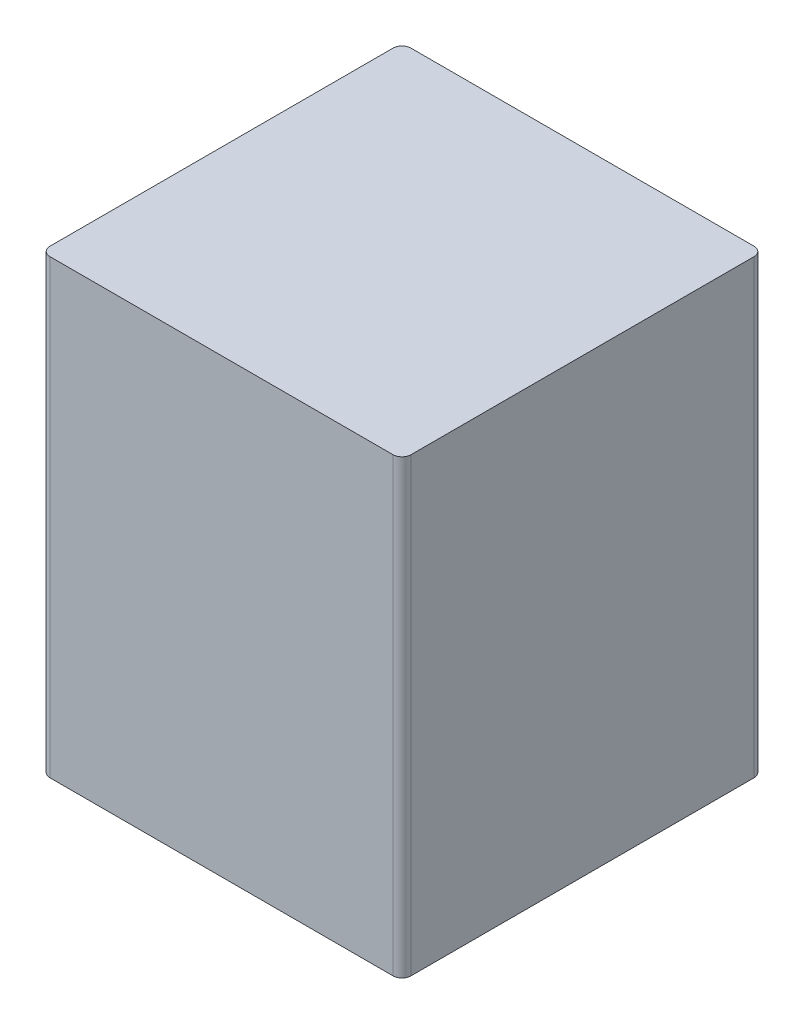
ISO-10303-21;
HEADER;
FILE_DESCRIPTION(('STEP AP214'),'2;1');
FILE_NAME('part.step','',(''),(''),'','','');
FILE_SCHEMA(('AUTOMOTIVE_DESIGN { 1 0 10303 214 1 1 1 1 }'));
ENDSEC;
DATA;
#1=APPLICATION_CONTEXT('core data for automotive mechanical design processes');
#2=APPLICATION_PROTOCOL_DEFINITION('international standard','automotive_design',2000,#1);
#3=PRODUCT_CONTEXT('',#1,'mechanical');
#4=PRODUCT('Part','Part','',(#3));
#5=PRODUCT_RELATED_PRODUCT_CATEGORY('part','',(#4));
#6=PRODUCT_DEFINITION_FORMATION('','',#4);
#7=PRODUCT_DEFINITION_CONTEXT('part definition',#1,'design');
#8=PRODUCT_DEFINITION('design','',#6,#7);
#9=PRODUCT_DEFINITION_SHAPE('','',#8);
#10=(LENGTH_UNIT() NAMED_UNIT(*) SI_UNIT(.MILLI.,.METRE.));
#11=(NAMED_UNIT(*) PLANE_ANGLE_UNIT() SI_UNIT($,.RADIAN.));
#12=(NAMED_UNIT(*) SI_UNIT($,.STERADIAN.) SOLID_ANGLE_UNIT());
#13=UNCERTAINTY_MEASURE_WITH_UNIT(LENGTH_MEASURE(1.E-05),#10,'distance_accuracy_value','');
#14=(GEOMETRIC_REPRESENTATION_CONTEXT(3) GLOBAL_UNCERTAINTY_ASSIGNED_CONTEXT((#13)) GLOBAL_UNIT_ASSIGNED_CONTEXT((#10,
#11,#12)) REPRESENTATION_CONTEXT('',''));
#15=CARTESIAN_POINT('',(0.,0.,0.));
#16=DIRECTION('',(0.,0.,1.));
#17=DIRECTION('',(1.,0.,0.));
#18=AXIS2_PLACEMENT_3D('',#15,#16,#17);
#19=CARTESIAN_POINT('',(-0.38,-0.5,0.38));
#20=DIRECTION('',(0.,-1.,0.));
#21=DIRECTION('',(0.,0.,1.));
#22=AXIS2_PLACEMENT_3D('',#19,#20,#21);
#23=CYLINDRICAL_SURFACE('',#22,0.02);
#24=CARTESIAN_POINT('',(-0.38,0.5,0.38));
#25=DIRECTION('',(0.,-1.,0.));
#26=DIRECTION('',(0.,0.,-1.));
#27=AXIS2_PLACEMENT_3D('',#24,#25,#26);
#28=CIRCLE('',#27,0.02);
#29=CARTESIAN_POINT('',(-0.38,0.5,0.4));
#30=VERTEX_POINT('',#29);
#31=CARTESIAN_POINT('',(-0.4,0.5,0.38));
#32=VERTEX_POINT('',#31);
#33=EDGE_CURVE('E20',#30,#32,#28,.T.);
#34=ORIENTED_EDGE('',*,*,#33,.T.);
#35=DIRECTION('',(0.,-1.,0.));
#36=VECTOR('',#35,1.);
#37=CARTESIAN_POINT('',(-0.4,0.5,0.38));
#38=LINE('',#37,#36);
#39=CARTESIAN_POINT('',(-0.4,-0.5,0.38));
#40=VERTEX_POINT('',#39);
#41=EDGE_CURVE('E170',#32,#40,#38,.T.);
#42=ORIENTED_EDGE('',*,*,#41,.T.);
#43=CARTESIAN_POINT('',(-0.38,-0.5,0.38));
#44=DIRECTION('',(0.,1.,0.));
#45=DIRECTION('',(0.,0.,1.));
#46=AXIS2_PLACEMENT_3D('',#43,#44,#45);
#47=CIRCLE('',#46,0.02);
#48=CARTESIAN_POINT('',(-0.38,-0.5,0.4));
#49=VERTEX_POINT('',#48);
#50=EDGE_CURVE('E117',#40,#49,#47,.T.);
#51=ORIENTED_EDGE('',*,*,#50,.T.);
#52=DIRECTION('',(0.,-1.,0.));
#53=VECTOR('',#52,1.);
#54=CARTESIAN_POINT('',(-0.38,-0.5,0.4));
#55=LINE('',#54,#53);
#56=EDGE_CURVE('E147',#30,#49,#55,.T.);
#57=ORIENTED_EDGE('',*,*,#56,.F.);
#58=EDGE_LOOP('',(#34,#42,#51,#57));
#59=FACE_BOUND('',#58,.T.);
#60=ADVANCED_FACE('F17',(#59),#23,.T.);
#61=CARTESIAN_POINT('',(-0.38,0.5,-0.38));
#62=DIRECTION('',(0.,1.,0.));
#63=DIRECTION('',(0.,0.,-1.));
#64=AXIS2_PLACEMENT_3D('',#61,#62,#63);
#65=CYLINDRICAL_SURFACE('',#64,0.02);
#66=CARTESIAN_POINT('',(-0.38,0.5,-0.38));
#67=DIRECTION('',(0.,-1.,0.));
#68=DIRECTION('',(0.,0.,-1.));
#69=AXIS2_PLACEMENT_3D('',#66,#67,#68);
#70=CIRCLE('',#69,0.02);
#71=CARTESIAN_POINT('',(-0.4,0.5,-0.38));
#72=VERTEX_POINT('',#71);
#73=CARTESIAN_POINT('',(-0.38,0.5,-0.4));
#74=VERTEX_POINT('',#73);
#75=EDGE_CURVE('E11',#72,#74,#70,.T.);
#76=ORIENTED_EDGE('',*,*,#75,.T.);
#77=DIRECTION('',(0.,-1.,0.));
#78=VECTOR('',#77,1.);
#79=CARTESIAN_POINT('',(-0.38,-0.5,-0.4));
#80=LINE('',#79,#78);
#81=CARTESIAN_POINT('',(-0.38,-0.5,-0.4));
#82=VERTEX_POINT('',#81);
#83=EDGE_CURVE('E120',#74,#82,#80,.T.);
#84=ORIENTED_EDGE('',*,*,#83,.T.);
#85=CARTESIAN_POINT('',(-0.38,-0.5,-0.38));
#86=DIRECTION('',(0.,1.,0.));
#87=DIRECTION('',(0.,0.,1.));
#88=AXIS2_PLACEMENT_3D('',#85,#86,#87);
#89=CIRCLE('',#88,0.02);
#90=CARTESIAN_POINT('',(-0.4,-0.5,-0.38));
#91=VERTEX_POINT('',#90);
#92=EDGE_CURVE('E103',#82,#91,#89,.T.);
#93=ORIENTED_EDGE('',*,*,#92,.T.);
#94=DIRECTION('',(0.,-1.,0.));
#95=VECTOR('',#94,1.);
#96=CARTESIAN_POINT('',(-0.4,0.5,-0.38));
#97=LINE('',#96,#95);
#98=EDGE_CURVE('E175',#72,#91,#97,.T.);
#99=ORIENTED_EDGE('',*,*,#98,.F.);
#100=EDGE_LOOP('',(#76,#84,#93,#99));
#101=FACE_BOUND('',#100,.T.);
#102=ADVANCED_FACE('F121',(#101),#65,.T.);
#103=CARTESIAN_POINT('',(0.38,-0.5,-0.38));
#104=DIRECTION('',(0.,-1.,0.));
#105=DIRECTION('',(0.,0.,1.));
#106=AXIS2_PLACEMENT_3D('',#103,#104,#105);
#107=CYLINDRICAL_SURFACE('',#106,0.02);
#108=CARTESIAN_POINT('',(0.38,-0.5,-0.38));
#109=DIRECTION('',(0.,1.,0.));
#110=DIRECTION('',(0.,0.,1.));
#111=AXIS2_PLACEMENT_3D('',#108,#109,#110);
#112=CIRCLE('',#111,0.02);
#113=CARTESIAN_POINT('',(0.4,-0.5,-0.38));
#114=VERTEX_POINT('',#113);
#115=CARTESIAN_POINT('',(0.38,-0.5,-0.4));
#116=VERTEX_POINT('',#115);
#117=EDGE_CURVE('E116',#114,#116,#112,.T.);
#118=ORIENTED_EDGE('',*,*,#117,.T.);
#119=DIRECTION('',(0.,1.,0.));
#120=VECTOR('',#119,1.);
#121=CARTESIAN_POINT('',(0.38,-0.5,-0.4));
#122=LINE('',#121,#120);
#123=CARTESIAN_POINT('',(0.38,0.5,-0.4));
#124=VERTEX_POINT('',#123);
#125=EDGE_CURVE('E130',#116,#124,#122,.T.);
#126=ORIENTED_EDGE('',*,*,#125,.T.);
#127=CARTESIAN_POINT('',(0.38,0.5,-0.38));
#128=DIRECTION('',(0.,-1.,0.));
#129=DIRECTION('',(0.,0.,-1.));
#130=AXIS2_PLACEMENT_3D('',#127,#128,#129);
#131=CIRCLE('',#130,0.02);
#132=CARTESIAN_POINT('',(0.4,0.5,-0.38));
#133=VERTEX_POINT('',#132);
#134=EDGE_CURVE('E26',#124,#133,#131,.T.);
#135=ORIENTED_EDGE('',*,*,#134,.T.);
#136=DIRECTION('',(0.,1.,0.));
#137=VECTOR('',#136,1.);
#138=CARTESIAN_POINT('',(0.4,-0.5,-0.38));
#139=LINE('',#138,#137);
#140=EDGE_CURVE('E45',#114,#133,#139,.T.);
#141=ORIENTED_EDGE('',*,*,#140,.F.);
#142=EDGE_LOOP('',(#118,#126,#135,#141));
#143=FACE_BOUND('',#142,.T.);
#144=ADVANCED_FACE('F221',(#143),#107,.T.);
#145=CARTESIAN_POINT('',(0.4,0.5,0.4));
#146=DIRECTION('',(0.,-1.,0.));
#147=DIRECTION('',(0.,0.,-1.));
#148=AXIS2_PLACEMENT_3D('',#145,#146,#147);
#149=PLANE('',#148);
#150=DIRECTION('',(0.,0.,-1.));
#151=VECTOR('',#150,1.);
#152=CARTESIAN_POINT('',(-0.4,0.5,0.4));
#153=LINE('',#152,#151);
#154=EDGE_CURVE('E174',#32,#72,#153,.T.);
#155=ORIENTED_EDGE('',*,*,#154,.F.);
#156=ORIENTED_EDGE('',*,*,#33,.F.);
#157=DIRECTION('',(-1.,0.,0.));
#158=VECTOR('',#157,1.);
#159=CARTESIAN_POINT('',(0.4,0.5,0.4));
#160=LINE('',#159,#158);
#161=CARTESIAN_POINT('',(0.38,0.5,0.4));
#162=VERTEX_POINT('',#161);
#163=EDGE_CURVE('E143',#162,#30,#160,.T.);
#164=ORIENTED_EDGE('',*,*,#163,.F.);
#165=CARTESIAN_POINT('',(0.38,0.5,0.38));
#166=DIRECTION('',(0.,-1.,0.));
#167=DIRECTION('',(0.,0.,-1.));
#168=AXIS2_PLACEMENT_3D('',#165,#166,#167);
#169=CIRCLE('',#168,0.02);
#170=CARTESIAN_POINT('',(0.4,0.5,0.38));
#171=VERTEX_POINT('',#170);
#172=EDGE_CURVE('E153',#171,#162,#169,.T.);
#173=ORIENTED_EDGE('',*,*,#172,.F.);
#174=DIRECTION('',(0.,0.,-1.));
#175=VECTOR('',#174,1.);
#176=CARTESIAN_POINT('',(0.4,0.5,0.4));
#177=LINE('',#176,#175);
#178=EDGE_CURVE('E187',#171,#133,#177,.T.);
#179=ORIENTED_EDGE('',*,*,#178,.T.);
#180=ORIENTED_EDGE('',*,*,#134,.F.);
#181=DIRECTION('',(-1.,0.,0.));
#182=VECTOR('',#181,1.);
#183=CARTESIAN_POINT('',(0.4,0.5,-0.4));
#184=LINE('',#183,#182);
#185=EDGE_CURVE('E126',#124,#74,#184,.T.);
#186=ORIENTED_EDGE('',*,*,#185,.T.);
#187=ORIENTED_EDGE('',*,*,#75,.F.);
#188=EDGE_LOOP('',(#155,#156,#164,#173,#179,#180,#186,#187));
#189=FACE_BOUND('',#188,.T.);
#190=ADVANCED_FACE('F199',(#189),#149,.F.);
#191=CARTESIAN_POINT('',(0.4,-0.5,0.4));
#192=DIRECTION('',(-1.,0.,0.));
#193=DIRECTION('',(0.,0.,1.));
#194=AXIS2_PLACEMENT_3D('',#191,#192,#193);
#195=PLANE('',#194);
#196=DIRECTION('',(0.,0.,-1.));
#197=VECTOR('',#196,1.);
#198=CARTESIAN_POINT('',(0.4,-0.5,0.4));
#199=LINE('',#198,#197);
#200=CARTESIAN_POINT('',(0.4,-0.5,0.38));
#201=VERTEX_POINT('',#200);
#202=EDGE_CURVE('E183',#201,#114,#199,.T.);
#203=ORIENTED_EDGE('',*,*,#202,.T.);
#204=ORIENTED_EDGE('',*,*,#140,.T.);
#205=ORIENTED_EDGE('',*,*,#178,.F.);
#206=DIRECTION('',(0.,1.,0.));
#207=VECTOR('',#206,1.);
#208=CARTESIAN_POINT('',(0.4,-0.5,0.38));
#209=LINE('',#208,#207);
#210=EDGE_CURVE('E149',#201,#171,#209,.T.);
#211=ORIENTED_EDGE('',*,*,#210,.F.);
#212=EDGE_LOOP('',(#203,#204,#205,#211));
#213=FACE_BOUND('',#212,.T.);
#214=ADVANCED_FACE('F214',(#213),#195,.F.);
#215=CARTESIAN_POINT('',(-0.4,-0.5,0.4));
#216=DIRECTION('',(0.,1.,0.));
#217=DIRECTION('',(1.,0.,0.));
#218=AXIS2_PLACEMENT_3D('',#215,#216,#217);
#219=PLANE('',#218);
#220=DIRECTION('',(1.,0.,0.));
#221=VECTOR('',#220,1.);
#222=CARTESIAN_POINT('',(-0.4,-0.5,0.4));
#223=LINE('',#222,#221);
#224=CARTESIAN_POINT('',(0.38,-0.5,0.4));
#225=VERTEX_POINT('',#224);
#226=EDGE_CURVE('E165',#49,#225,#223,.T.);
#227=ORIENTED_EDGE('',*,*,#226,.F.);
#228=ORIENTED_EDGE('',*,*,#50,.F.);
#229=DIRECTION('',(0.,0.,-1.));
#230=VECTOR('',#229,1.);
#231=CARTESIAN_POINT('',(-0.4,-0.5,0.4));
#232=LINE('',#231,#230);
#233=EDGE_CURVE('E111',#40,#91,#232,.T.);
#234=ORIENTED_EDGE('',*,*,#233,.T.);
#235=ORIENTED_EDGE('',*,*,#92,.F.);
#236=DIRECTION('',(1.,0.,0.));
#237=VECTOR('',#236,1.);
#238=CARTESIAN_POINT('',(-0.4,-0.5,-0.4));
#239=LINE('',#238,#237);
#240=EDGE_CURVE('E109',#82,#116,#239,.T.);
#241=ORIENTED_EDGE('',*,*,#240,.T.);
#242=ORIENTED_EDGE('',*,*,#117,.F.);
#243=ORIENTED_EDGE('',*,*,#202,.F.);
#244=CARTESIAN_POINT('',(0.38,-0.5,0.38));
#245=DIRECTION('',(0.,1.,0.));
#246=DIRECTION('',(0.,0.,1.));
#247=AXIS2_PLACEMENT_3D('',#244,#245,#246);
#248=CIRCLE('',#247,0.02);
#249=EDGE_CURVE('E142',#225,#201,#248,.T.);
#250=ORIENTED_EDGE('',*,*,#249,.F.);
#251=EDGE_LOOP('',(#227,#228,#234,#235,#241,#242,#243,#250));
#252=FACE_BOUND('',#251,.T.);
#253=ADVANCED_FACE('F106',(#252),#219,.F.);
#254=CARTESIAN_POINT('',(-0.4,0.5,0.4));
#255=DIRECTION('',(1.,0.,0.));
#256=DIRECTION('',(0.,1.,0.));
#257=AXIS2_PLACEMENT_3D('',#254,#255,#256);
#258=PLANE('',#257);
#259=ORIENTED_EDGE('',*,*,#233,.F.);
#260=ORIENTED_EDGE('',*,*,#41,.F.);
#261=ORIENTED_EDGE('',*,*,#154,.T.);
#262=ORIENTED_EDGE('',*,*,#98,.T.);
#263=EDGE_LOOP('',(#259,#260,#261,#262));
#264=FACE_BOUND('',#263,.T.);
#265=ADVANCED_FACE('F201',(#264),#258,.F.);
#266=CARTESIAN_POINT('',(-0.4,-0.5,0.4));
#267=DIRECTION('',(0.,0.,1.));
#268=DIRECTION('',(1.,0.,0.));
#269=AXIS2_PLACEMENT_3D('',#266,#267,#268);
#270=PLANE('',#269);
#271=ORIENTED_EDGE('',*,*,#163,.T.);
#272=ORIENTED_EDGE('',*,*,#56,.T.);
#273=ORIENTED_EDGE('',*,*,#226,.T.);
#274=DIRECTION('',(0.,1.,0.));
#275=VECTOR('',#274,1.);
#276=CARTESIAN_POINT('',(0.38,0.5,0.4));
#277=LINE('',#276,#275);
#278=EDGE_CURVE('E148',#225,#162,#277,.T.);
#279=ORIENTED_EDGE('',*,*,#278,.T.);
#280=EDGE_LOOP('',(#271,#272,#273,#279));
#281=FACE_BOUND('',#280,.T.);
#282=ADVANCED_FACE('F203',(#281),#270,.T.);
#283=CARTESIAN_POINT('',(0.38,-0.5,0.38));
#284=DIRECTION('',(0.,1.,0.));
#285=DIRECTION('',(0.,0.,-1.));
#286=AXIS2_PLACEMENT_3D('',#283,#284,#285);
#287=CYLINDRICAL_SURFACE('',#286,0.02);
#288=ORIENTED_EDGE('',*,*,#249,.T.);
#289=ORIENTED_EDGE('',*,*,#210,.T.);
#290=ORIENTED_EDGE('',*,*,#172,.T.);
#291=ORIENTED_EDGE('',*,*,#278,.F.);
#292=EDGE_LOOP('',(#288,#289,#290,#291));
#293=FACE_BOUND('',#292,.T.);
#294=ADVANCED_FACE('F211',(#293),#287,.T.);
#295=CARTESIAN_POINT('',(-0.4,-0.5,-0.4));
#296=DIRECTION('',(0.,0.,1.));
#297=DIRECTION('',(1.,0.,0.));
#298=AXIS2_PLACEMENT_3D('',#295,#296,#297);
#299=PLANE('',#298);
#300=ORIENTED_EDGE('',*,*,#240,.F.);
#301=ORIENTED_EDGE('',*,*,#83,.F.);
#302=ORIENTED_EDGE('',*,*,#185,.F.);
#303=ORIENTED_EDGE('',*,*,#125,.F.);
#304=EDGE_LOOP('',(#300,#301,#302,#303));
#305=FACE_BOUND('',#304,.T.);
#306=ADVANCED_FACE('F129',(#305),#299,.F.);
#307=CLOSED_SHELL('',(#60,#102,#144,#190,#214,#253,#265,#282,#294,#306));
#308=MANIFOLD_SOLID_BREP('B1',#307);
#309=ADVANCED_BREP_SHAPE_REPRESENTATION('',(#18,#308),#14);
#310=SHAPE_DEFINITION_REPRESENTATION(#9,#309);
ENDSEC;
END-ISO-10303-21;
